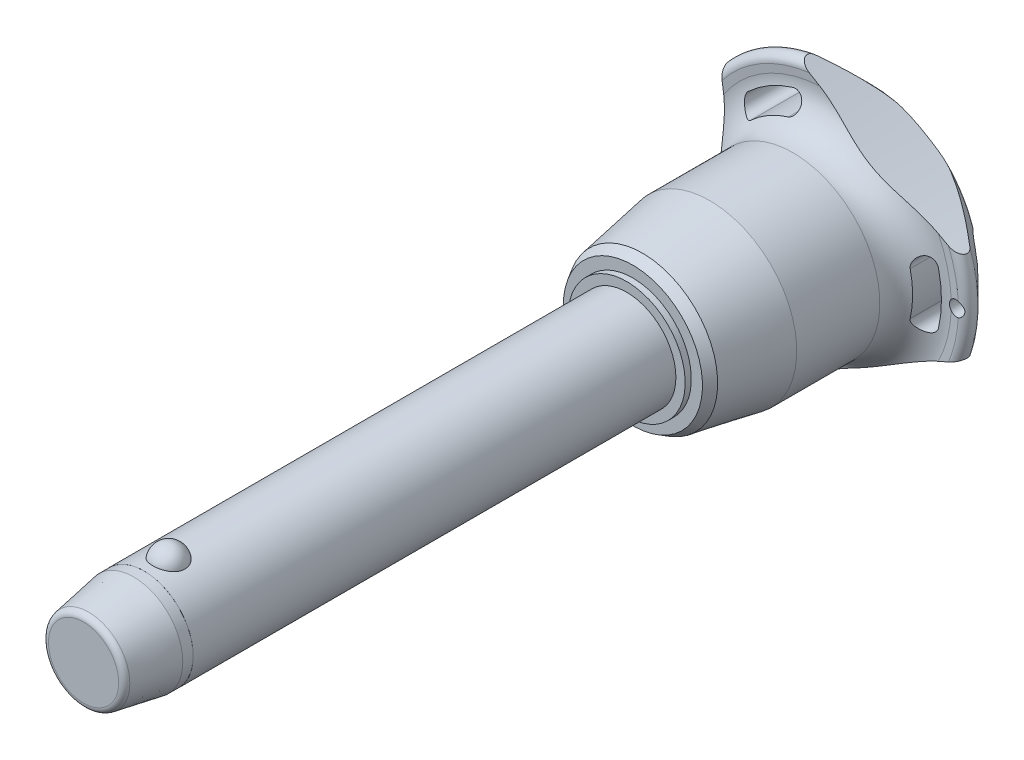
from build123d import *

# Parameters (mm, degrees)
SKETCH1_R           = 10
BOSS_EXTRUDE1_DEPTH = 90
SKETCH2_R           = 8.75
BOSS_EXTRUDE2_DEPTH = 50.7
BOSS_EXTRUDE3_START = 20.5
SKETCH1_2_R         = 10
BOSS_EXTRUDE3_DEPTH = 20.5
CHAMFER1_SIZE       = 10.25
CHAMFER1_SIZE2      = 1.807351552
FILLET1_R           = 1.25
SKETCH6_R           = 176.92625
CUT_EXTRUDE1_DEPTH  = 147.379068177
CIRPATTERN1_COUNT   = 3
SKETCH7_R           = 1.5
CUT_EXTRUDE2_DEPTH  = 147.275035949
SKETCH8_R           = 10
SKETCH8_R_2         = 9.99
CUT_EXTRUDE3_DEPTH  = 12.3


with BuildPart() as part:
    # Sketch1 → Boss-Extrude1 (new body)
    with BuildSketch(Plane.XY):
        Circle(SKETCH1_R)
    extrude(amount=-BOSS_EXTRUDE1_DEPTH)

    # Sketch2 → Boss-Extrude2 (add)
    with BuildSketch(Plane(origin=(0, 0, -90), x_dir=(-1, 0, 0), z_dir=(0, 0, -1))):
        with Locations(Location((0, 0, 0), (0, 0, 180))):
            Circle(SKETCH2_R)
    extrude(amount=BOSS_EXTRUDE2_DEPTH)

    # Sketch3 → Revolve1 (revolve)
    with BuildSketch(Plane(origin=(0, 0, 0), x_dir=(0, 0, -1), z_dir=(1, 0, 0))):
        with BuildLine():
            Line((-3.201562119, 12.5), (-3.201562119, 5.9))
            ThreePointArc((-3.201562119, 5.9), (0.098437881, 9.2), (-3.201562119, 12.5))
        make_face()
        with BuildLine():
            Line((-3.201562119, -5.9), (-3.201562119, -12.5))
            ThreePointArc((-3.201562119, -12.5), (0.098437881, -9.2), (-3.201562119, -5.9))
        make_face()
    revolve(axis=Axis((0, -5.9, 3.201562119), (0, 1, 0)))

    # Sketch1_2 → Boss-Extrude3 (add)
    with BuildSketch(Plane.XY.offset(BOSS_EXTRUDE3_START)):
        Circle(SKETCH1_2_R)
    extrude(amount=-BOSS_EXTRUDE3_DEPTH)

    # Chamfer1
    chamfer1_edges = [part.edges().sort_by_distance(p)[0] for p in [
        (-10, 0, 20.5),
    ]]
    chamfer1_side = [part.faces().sort_by_distance(p)[0] for p in [
        (-10, 0, -34.75),
    ]]
    chamfer(chamfer1_edges, length=CHAMFER1_SIZE, length2=CHAMFER1_SIZE2, reference=chamfer1_side[0])

    # Fillet1
    fillet1_edges = [part.edges().sort_by_distance(p)[0] for p in [
        (-8.192648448, 0, 20.5),
        (-8.75, 0, -140.7),
    ]]
    fillet(fillet1_edges, radius=FILLET1_R)

    # Sketch4 → Revolve2 (revolve)
    with BuildSketch(Plane(origin=(0, 0, 0), x_dir=(0, 0, -1), z_dir=(1, 0, 0)), mode=Mode.PRIVATE) as revolve2_sk:
        Polygon((90, 0), (90, 11.888848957), (91.25, 11.888848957), (91.25, 14.153854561), (93.211552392, 15.286357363), (106.9, 17.7), (123.8, 17.7), (123.8, 0), align=None)
    revolve(revolve2_sk.sketch.rotate(Axis((0, 0, -123.8), (0, 0, 1)), 90), axis=Axis((0, 0, -123.8), (0, 0, 1)))

    # Sketch5 → Revolve3 (revolve)
    with BuildSketch(Plane(origin=(0, 0, 0), x_dir=(0, 0, -1), z_dir=(1, 0, 0)), mode=Mode.PRIVATE) as revolve3_sk:
        with BuildLine():
            Line((130.778589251, 25.247075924), (130.654893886, 26.824954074))
            ThreePointArc((130.654893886, 26.824954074), (131.580366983, 28.40313166), (133.38137085, 28.08137085))
            Line((133.38137085, 28.08137085), (139.763226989, 21.69951471))
            ThreePointArc((139.763226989, 21.69951471), (140.7, 19.381044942), (139.683055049, 17.096604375))
            ThreePointArc((139.683055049, 17.096604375), (134.18864484, 9.321268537), (132.25, 0))
            Line((132.25, 0), (123.8, 0))
            Line((123.8, 0), (123.8, 17.7))
            ThreePointArc((123.8, 17.7), (128.939529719, 19.947607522), (130.778589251, 25.247075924))
        make_face()
    revolve(revolve3_sk.sketch.rotate(Axis((0, 0, -132.25), (0, 0, 1)), 90), axis=Axis((0, 0, -132.25), (0, 0, 1)))

    # Sketch6 → Cut-Extrude1 (cut, through all)
    with BuildSketch(Plane.XY):
        with Locations((-197.42625, 0)):
            Circle(SKETCH6_R)
        with BuildLine():
            ThreePointArc((22.762066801, -5.252833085), (23.360306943, 0), (22.762066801, 5.252833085))
            ThreePointArc((22.762066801, 5.252833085), (20.499354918, 6.667021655), (19.085166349, 4.404309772))
            ThreePointArc((19.085166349, 4.404309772), (19.586768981, 0), (19.085166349, -4.404309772))
            ThreePointArc((19.085166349, -4.404309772), (20.499354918, -6.667021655), (22.762066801, -5.252833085))
        make_face()
    cut_extrude1 = extrude(amount=-CUT_EXTRUDE1_DEPTH, mode=Mode.SUBTRACT)

    # CirPattern1: Cut-Extrude1 ×3 about axis
    cirpattern1_axis = Axis((0, 0, 0), (0, 0, 1))
    for i in range(1, CIRPATTERN1_COUNT):
        add(cut_extrude1.rotate(cirpattern1_axis, i * 360 / CIRPATTERN1_COUNT), mode=Mode.SUBTRACT)

    # Sketch7 → Cut-Extrude2 (cut, through all)
    with BuildSketch(Plane.XY):
        with Locations(Location((26.360306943, 0, 0), (0, 0, 286.501656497))):
            Circle(SKETCH7_R)
    extrude(amount=-CUT_EXTRUDE2_DEPTH, mode=Mode.SUBTRACT)

    # Sketch8 → Cut-Extrude3 (cut)
    with BuildSketch(Plane.XY.offset(20.5)):
        Circle(SKETCH8_R)
        Circle(SKETCH8_R_2, mode=Mode.SUBTRACT)
    extrude(amount=-CUT_EXTRUDE3_DEPTH, mode=Mode.SUBTRACT)


solid = part.part
